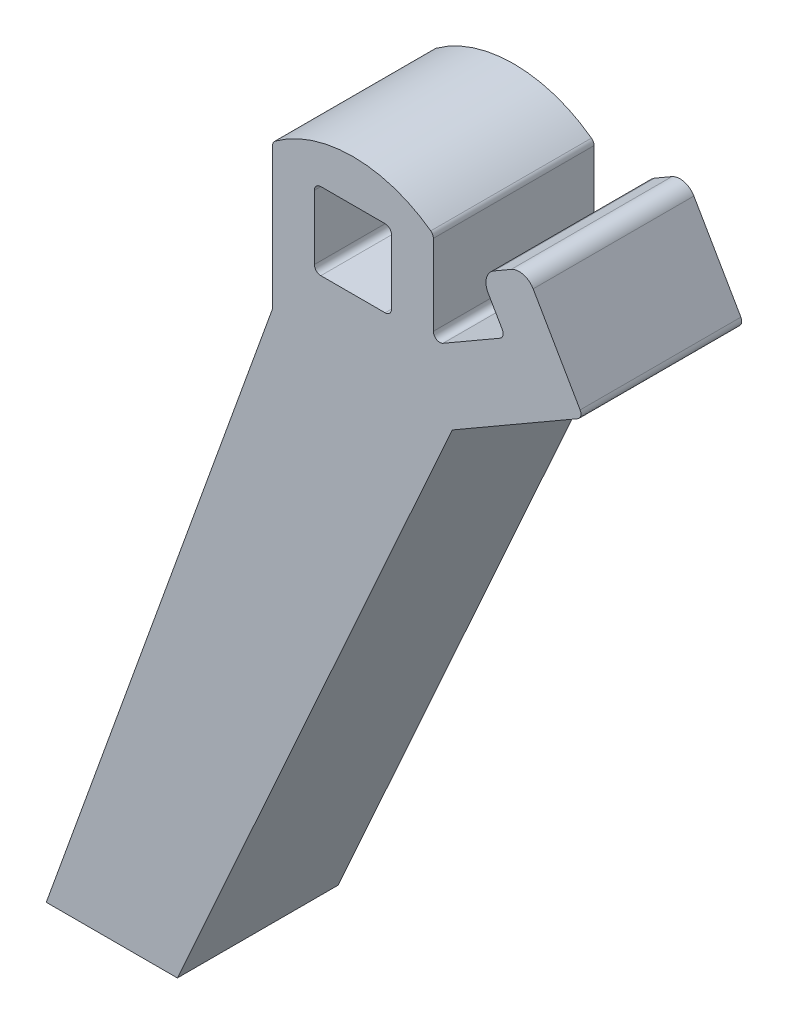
from build123d import *

# Parameters (mm, degrees)
SKETCH1_W           = 3.048
SKETCH1_H           = 3.048
BOSS_EXTRUDE1_DEPTH = 6.35
FILLET2_R           = 0.254
FILLET3_R           = 0.254
FILLET4_R           = 0.635
FILLET5_R           = 0.254


with BuildPart() as part:
    # Sketch1 → Boss-Extrude1 (new body)
    with BuildSketch(Plane.XY):
        with BuildLine():
            Line((0, 0), (5.179316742, 0))
            Line((5.179316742, 0), (16.039676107, 24.180743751))
            Line((16.039676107, 24.180743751), (21.216631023, 27.169660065))
            Line((21.216631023, 27.169660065), (18.916314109, 31.153925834))
            Line((18.916314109, 31.153925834), (17.13594797, 30.126030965))
            Line((17.13594797, 30.126030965), (18.140640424, 28.38585259))
            Line((18.140640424, 28.38585259), (15.291404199, 26.740845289))
            Line((15.291404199, 26.740845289), (15.291404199, 30.486502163))
            ThreePointArc((15.291404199, 30.486502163), (12.116404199, 31.571414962), (8.941404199, 30.486502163))
            Line((8.941404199, 30.486502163), (8.941404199, 24.782735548))
            Line((8.941404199, 24.782735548), (0, 0))
        make_face()
        with Locations((12.116404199, 28.38585259)):
            Rectangle(SKETCH1_W, SKETCH1_H, mode=Mode.SUBTRACT)
    extrude(amount=BOSS_EXTRUDE1_DEPTH)

    # Fillet2
    fillet2_edges = [part.edges().sort_by_distance(p)[0] for p in [
        (8.941404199, 30.486502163, 3.175),
        (15.291404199, 30.486502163, 3.175),
    ]]
    fillet(fillet2_edges, radius=FILLET2_R)

    # Fillet3
    fillet3_edges = [part.edges().sort_by_distance(p)[0] for p in [
        (15.291404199, 26.740845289, 3.175),
        (18.140640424, 28.38585259, 3.175),
        (21.216631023, 27.169660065, 3.175),
    ]]
    fillet(fillet3_edges, radius=FILLET3_R)

    # Fillet4
    fillet4_edges = [part.edges().sort_by_distance(p)[0] for p in [
        (17.13594797, 30.126030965, 3.175),
        (18.916314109, 31.153925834, 3.175),
    ]]
    fillet(fillet4_edges, radius=FILLET4_R)

    # Fillet5
    fillet5_edges = [part.edges().sort_by_distance(p)[0] for p in [
        (13.640404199, 26.86185259, 3.175),
        (13.640404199, 29.90985259, 3.175),
        (10.592404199, 29.90985259, 3.175),
        (10.592404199, 26.86185259, 3.175),
    ]]
    fillet(fillet5_edges, radius=FILLET5_R)


solid = part.part
